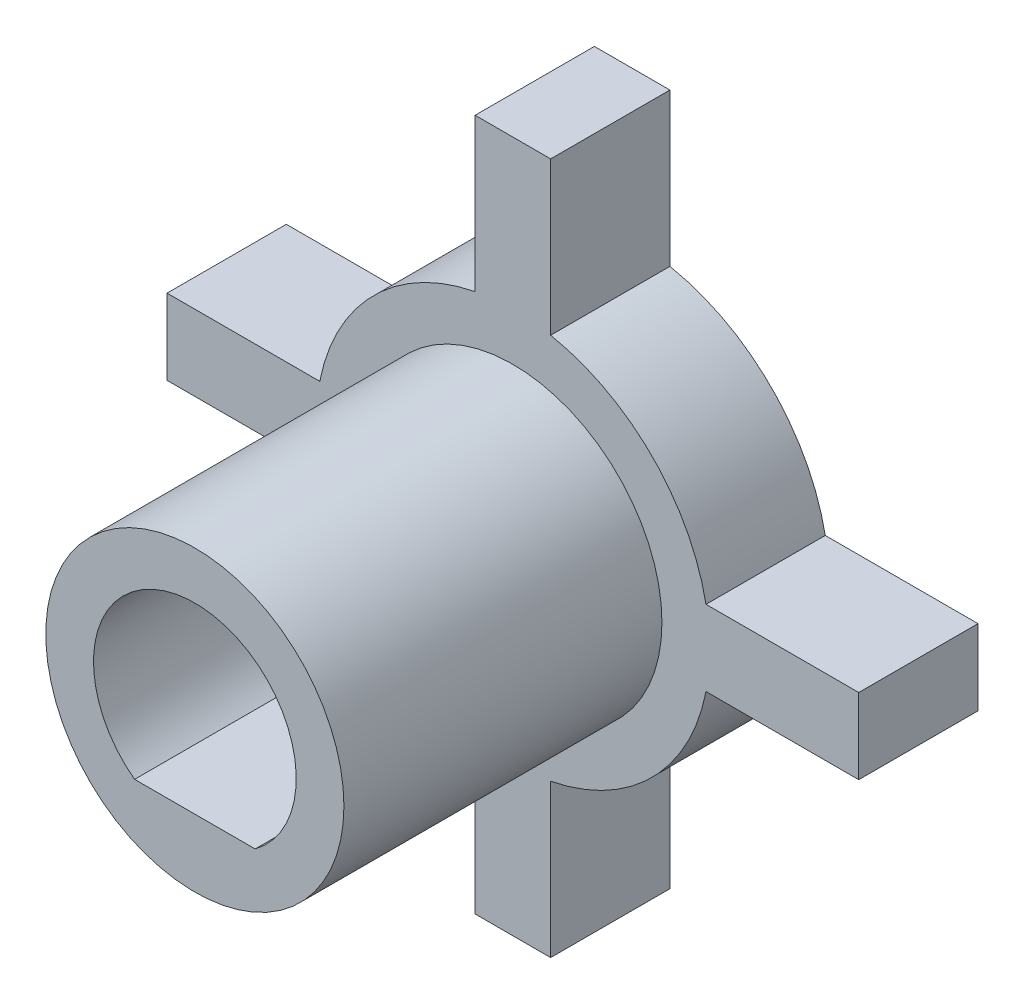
from build123d import *

# Parameters (mm, degrees)
EXTRUDE_1_DEPTH     = 6
SKETCH_2_R          = 7.5
EXTRUDE_2_DEPTH     = 16
CUT_EXTRUDE_1_DEPTH = 34.007877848


with BuildPart() as part:
    # Sketch 1 → Extrude 1 (new body)
    with BuildSketch(Plane.XY):
        with BuildLine():
            Line((-1.9, -17.4), (1.9, -17.4))
            Line((1.9, -17.4), (1.9, -9.715966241))
            ThreePointArc((1.9, -9.715966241), (7.000357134, -7.000357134), (9.715966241, -1.9))
            Line((9.715966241, -1.9), (17.4, -1.9))
            Line((17.4, -1.9), (17.4, 1.9))
            Line((17.4, 1.9), (9.715966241, 1.9))
            ThreePointArc((9.715966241, 1.9), (7.000357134, 7.000357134), (1.9, 9.715966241))
            Line((1.9, 9.715966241), (1.9, 17.4))
            Line((1.9, 17.4), (-1.9, 17.4))
            Line((-1.9, 17.4), (-1.9, 9.715966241))
            ThreePointArc((-1.9, 9.715966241), (-7.000357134, 7.000357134), (-9.715966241, 1.9))
            Line((-9.715966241, 1.9), (-17.4, 1.9))
            Line((-17.4, 1.9), (-17.4, -1.9))
            Line((-17.4, -1.9), (-9.715966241, -1.9))
            ThreePointArc((-9.715966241, -1.9), (-7.000357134, -7.000357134), (-1.9, -9.715966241))
            Line((-1.9, -9.715966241), (-1.9, -17.4))
        make_face()
    extrude(amount=EXTRUDE_1_DEPTH)

    # Sketch 2 → Extrude 2 (add)
    with BuildSketch(Plane.XY.offset(6)):
        Circle(SKETCH_2_R)
    extrude(amount=EXTRUDE_2_DEPTH)

    # Sketch 3 → Cut-Extrude 1 (cut, through all)
    with BuildSketch(Plane.XY.offset(22)):
        with BuildLine():
            Line((-3.033150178, -4.1), (3.033150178, -4.1))
            ThreePointArc((3.033150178, -4.1), (0, 5.1), (-3.033150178, -4.1))
        make_face()
    extrude(amount=-CUT_EXTRUDE_1_DEPTH, mode=Mode.SUBTRACT)


solid = part.part
